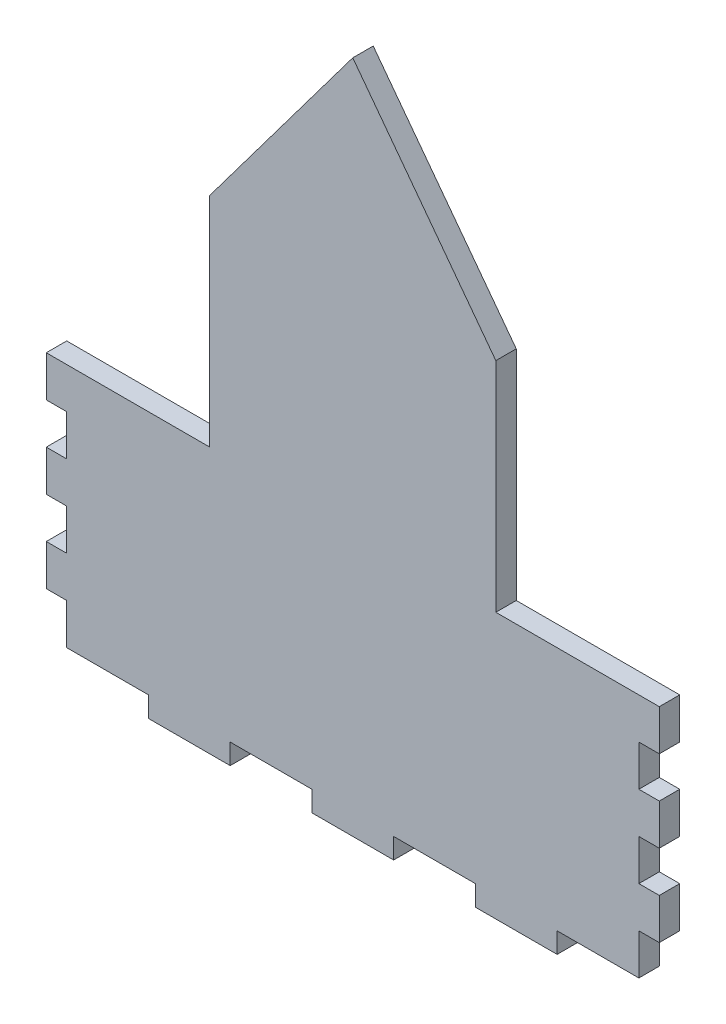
ISO-10303-21;
HEADER;
FILE_DESCRIPTION(('STEP AP214'),'2;1');
FILE_NAME('part.step','',(''),(''),'','','');
FILE_SCHEMA(('AUTOMOTIVE_DESIGN { 1 0 10303 214 1 1 1 1 }'));
ENDSEC;
DATA;
#1=APPLICATION_CONTEXT('core data for automotive mechanical design processes');
#2=APPLICATION_PROTOCOL_DEFINITION('international standard','automotive_design',2000,#1);
#3=PRODUCT_CONTEXT('',#1,'mechanical');
#4=PRODUCT('Part','Part','',(#3));
#5=PRODUCT_RELATED_PRODUCT_CATEGORY('part','',(#4));
#6=PRODUCT_DEFINITION_FORMATION('','',#4);
#7=PRODUCT_DEFINITION_CONTEXT('part definition',#1,'design');
#8=PRODUCT_DEFINITION('design','',#6,#7);
#9=PRODUCT_DEFINITION_SHAPE('','',#8);
#10=(LENGTH_UNIT() NAMED_UNIT(*) SI_UNIT(.MILLI.,.METRE.));
#11=(NAMED_UNIT(*) PLANE_ANGLE_UNIT() SI_UNIT($,.RADIAN.));
#12=(NAMED_UNIT(*) SI_UNIT($,.STERADIAN.) SOLID_ANGLE_UNIT());
#13=UNCERTAINTY_MEASURE_WITH_UNIT(LENGTH_MEASURE(1.E-05),#10,'distance_accuracy_value','');
#14=(GEOMETRIC_REPRESENTATION_CONTEXT(3) GLOBAL_UNCERTAINTY_ASSIGNED_CONTEXT((#13)) GLOBAL_UNIT_ASSIGNED_CONTEXT((#10,
#11,#12)) REPRESENTATION_CONTEXT('',''));
#15=CARTESIAN_POINT('',(0.,0.,0.));
#16=DIRECTION('',(0.,0.,1.));
#17=DIRECTION('',(1.,0.,0.));
#18=AXIS2_PLACEMENT_3D('',#15,#16,#17);
#19=CARTESIAN_POINT('',(175.806307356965,0.,12.7));
#20=DIRECTION('',(0.,1.,0.));
#21=DIRECTION('',(0.,0.,1.));
#22=AXIS2_PLACEMENT_3D('',#19,#20,#21);
#23=PLANE('',#22);
#24=DIRECTION('',(0.,0.,-1.));
#25=VECTOR('',#24,1.);
#26=CARTESIAN_POINT('',(254.,0.,-270.559651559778));
#27=LINE('',#26,#25);
#28=CARTESIAN_POINT('',(254.,0.,12.7));
#29=VERTEX_POINT('',#28);
#30=CARTESIAN_POINT('',(254.,0.,0.));
#31=VERTEX_POINT('',#30);
#32=EDGE_CURVE('E60',#29,#31,#27,.T.);
#33=ORIENTED_EDGE('',*,*,#32,.F.);
#34=DIRECTION('',(1.,0.,0.));
#35=VECTOR('',#34,1.);
#36=CARTESIAN_POINT('',(175.806307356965,0.,12.7));
#37=LINE('',#36,#35);
#38=CARTESIAN_POINT('',(203.2,0.,12.7));
#39=VERTEX_POINT('',#38);
#40=EDGE_CURVE('E323',#39,#29,#37,.T.);
#41=ORIENTED_EDGE('',*,*,#40,.F.);
#42=DIRECTION('',(0.,0.,-1.));
#43=VECTOR('',#42,1.);
#44=CARTESIAN_POINT('',(203.2,0.,-270.559651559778));
#45=LINE('',#44,#43);
#46=CARTESIAN_POINT('',(203.2,0.,0.));
#47=VERTEX_POINT('',#46);
#48=EDGE_CURVE('E324',#39,#47,#45,.T.);
#49=ORIENTED_EDGE('',*,*,#48,.T.);
#50=DIRECTION('',(1.,0.,0.));
#51=VECTOR('',#50,1.);
#52=CARTESIAN_POINT('',(175.806307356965,0.,0.));
#53=LINE('',#52,#51);
#54=EDGE_CURVE('E381',#47,#31,#53,.T.);
#55=ORIENTED_EDGE('',*,*,#54,.T.);
#56=EDGE_LOOP('',(#33,#41,#49,#55));
#57=FACE_BOUND('',#56,.T.);
#58=ADVANCED_FACE('F35',(#57),#23,.F.);
#59=DIRECTION('',(0.,0.,-1.));
#60=VECTOR('',#59,1.);
#61=CARTESIAN_POINT('',(152.4,0.,-270.559651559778));
#62=LINE('',#61,#60);
#63=CARTESIAN_POINT('',(152.4,0.,12.7));
#64=VERTEX_POINT('',#63);
#65=CARTESIAN_POINT('',(152.4,0.,0.));
#66=VERTEX_POINT('',#65);
#67=EDGE_CURVE('E327',#64,#66,#62,.T.);
#68=ORIENTED_EDGE('',*,*,#67,.F.);
#69=CARTESIAN_POINT('',(101.6,0.,12.7));
#70=VERTEX_POINT('',#69);
#71=EDGE_CURVE('E671',#70,#64,#37,.T.);
#72=ORIENTED_EDGE('',*,*,#71,.F.);
#73=DIRECTION('',(0.,0.,-1.));
#74=VECTOR('',#73,1.);
#75=CARTESIAN_POINT('',(101.6,0.,-270.559651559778));
#76=LINE('',#75,#74);
#77=CARTESIAN_POINT('',(101.6,0.,0.));
#78=VERTEX_POINT('',#77);
#79=EDGE_CURVE('E355',#70,#78,#76,.T.);
#80=ORIENTED_EDGE('',*,*,#79,.T.);
#81=EDGE_CURVE('E384',#78,#66,#53,.T.);
#82=ORIENTED_EDGE('',*,*,#81,.T.);
#83=EDGE_LOOP('',(#68,#72,#80,#82));
#84=FACE_BOUND('',#83,.T.);
#85=ADVANCED_FACE('F628',(#84),#23,.F.);
#86=DIRECTION('',(0.,0.,-1.));
#87=VECTOR('',#86,1.);
#88=CARTESIAN_POINT('',(50.8,0.,-270.559651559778));
#89=LINE('',#88,#87);
#90=CARTESIAN_POINT('',(50.8,0.,12.7));
#91=VERTEX_POINT('',#90);
#92=CARTESIAN_POINT('',(50.8,0.,0.));
#93=VERTEX_POINT('',#92);
#94=EDGE_CURVE('E360',#91,#93,#89,.T.);
#95=ORIENTED_EDGE('',*,*,#94,.F.);
#96=CARTESIAN_POINT('',(0.,0.,12.7));
#97=VERTEX_POINT('',#96);
#98=EDGE_CURVE('E421',#97,#91,#37,.T.);
#99=ORIENTED_EDGE('',*,*,#98,.F.);
#100=DIRECTION('',(0.,0.,-1.));
#101=VECTOR('',#100,1.);
#102=CARTESIAN_POINT('',(0.,0.,12.7));
#103=LINE('',#102,#101);
#104=CARTESIAN_POINT('',(0.,0.,0.));
#105=VERTEX_POINT('',#104);
#106=EDGE_CURVE('E690',#97,#105,#103,.T.);
#107=ORIENTED_EDGE('',*,*,#106,.T.);
#108=EDGE_CURVE('E399',#105,#93,#53,.T.);
#109=ORIENTED_EDGE('',*,*,#108,.T.);
#110=EDGE_LOOP('',(#95,#99,#107,#109));
#111=FACE_BOUND('',#110,.T.);
#112=ADVANCED_FACE('F634',(#111),#23,.F.);
#113=CARTESIAN_POINT('',(355.6,-268.81759320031,12.7));
#114=DIRECTION('',(-1.,0.,0.));
#115=DIRECTION('',(0.,-1.,0.));
#116=AXIS2_PLACEMENT_3D('',#113,#114,#115);
#117=PLANE('',#116);
#118=DIRECTION('',(0.,0.,1.));
#119=VECTOR('',#118,1.);
#120=CARTESIAN_POINT('',(355.6,25.4,0.));
#121=LINE('',#120,#119);
#122=CARTESIAN_POINT('',(355.6,25.4,0.));
#123=VERTEX_POINT('',#122);
#124=CARTESIAN_POINT('',(355.6,25.4,12.7));
#125=VERTEX_POINT('',#124);
#126=EDGE_CURVE('E771',#123,#125,#121,.T.);
#127=ORIENTED_EDGE('',*,*,#126,.T.);
#128=DIRECTION('',(0.,1.,0.));
#129=VECTOR('',#128,1.);
#130=CARTESIAN_POINT('',(355.6,-268.81759320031,12.7));
#131=LINE('',#130,#129);
#132=CARTESIAN_POINT('',(355.6,0.,12.7));
#133=VERTEX_POINT('',#132);
#134=EDGE_CURVE('E405',#133,#125,#131,.T.);
#135=ORIENTED_EDGE('',*,*,#134,.F.);
#136=DIRECTION('',(0.,0.,-1.));
#137=VECTOR('',#136,1.);
#138=CARTESIAN_POINT('',(355.6,0.,12.7));
#139=LINE('',#138,#137);
#140=CARTESIAN_POINT('',(355.6,0.,0.));
#141=VERTEX_POINT('',#140);
#142=EDGE_CURVE('E693',#133,#141,#139,.T.);
#143=ORIENTED_EDGE('',*,*,#142,.T.);
#144=DIRECTION('',(0.,1.,0.));
#145=VECTOR('',#144,1.);
#146=CARTESIAN_POINT('',(355.6,-268.81759320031,0.));
#147=LINE('',#146,#145);
#148=EDGE_CURVE('E538',#141,#123,#147,.T.);
#149=ORIENTED_EDGE('',*,*,#148,.T.);
#150=EDGE_LOOP('',(#127,#135,#143,#149));
#151=FACE_BOUND('',#150,.T.);
#152=ADVANCED_FACE('F645',(#151),#117,.F.);
#153=DIRECTION('',(0.,0.,1.));
#154=VECTOR('',#153,1.);
#155=CARTESIAN_POINT('',(355.6,101.6,0.));
#156=LINE('',#155,#154);
#157=CARTESIAN_POINT('',(355.6,101.6,0.));
#158=VERTEX_POINT('',#157);
#159=CARTESIAN_POINT('',(355.6,101.6,12.7));
#160=VERTEX_POINT('',#159);
#161=EDGE_CURVE('E565',#158,#160,#156,.T.);
#162=ORIENTED_EDGE('',*,*,#161,.F.);
#163=CARTESIAN_POINT('',(355.6,127.,0.));
#164=VERTEX_POINT('',#163);
#165=EDGE_CURVE('E401',#158,#164,#147,.T.);
#166=ORIENTED_EDGE('',*,*,#165,.T.);
#167=DIRECTION('',(0.,0.,1.));
#168=VECTOR('',#167,1.);
#169=CARTESIAN_POINT('',(355.6,127.,0.));
#170=LINE('',#169,#168);
#171=CARTESIAN_POINT('',(355.6,127.,12.7));
#172=VERTEX_POINT('',#171);
#173=EDGE_CURVE('E430',#164,#172,#170,.T.);
#174=ORIENTED_EDGE('',*,*,#173,.T.);
#175=EDGE_CURVE('E406',#160,#172,#131,.T.);
#176=ORIENTED_EDGE('',*,*,#175,.F.);
#177=EDGE_LOOP('',(#162,#166,#174,#176));
#178=FACE_BOUND('',#177,.T.);
#179=ADVANCED_FACE('F606',(#178),#117,.F.);
#180=CARTESIAN_POINT('',(0.,-268.81759320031,12.7));
#181=DIRECTION('',(-1.,0.,0.));
#182=DIRECTION('',(0.,0.,1.));
#183=AXIS2_PLACEMENT_3D('',#180,#181,#182);
#184=PLANE('',#183);
#185=DIRECTION('',(0.,1.,0.));
#186=VECTOR('',#185,1.);
#187=CARTESIAN_POINT('',(0.,-268.81759320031,12.7));
#188=LINE('',#187,#186);
#189=CARTESIAN_POINT('',(0.,25.4,12.7));
#190=VERTEX_POINT('',#189);
#191=EDGE_CURVE('E513',#97,#190,#188,.T.);
#192=ORIENTED_EDGE('',*,*,#191,.T.);
#193=DIRECTION('',(0.,0.,1.));
#194=VECTOR('',#193,1.);
#195=CARTESIAN_POINT('',(0.,25.4,0.));
#196=LINE('',#195,#194);
#197=CARTESIAN_POINT('',(0.,25.4,0.));
#198=VERTEX_POINT('',#197);
#199=EDGE_CURVE('E464',#198,#190,#196,.T.);
#200=ORIENTED_EDGE('',*,*,#199,.F.);
#201=DIRECTION('',(0.,1.,0.));
#202=VECTOR('',#201,1.);
#203=CARTESIAN_POINT('',(0.,-268.81759320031,0.));
#204=LINE('',#203,#202);
#205=EDGE_CURVE('E691',#105,#198,#204,.T.);
#206=ORIENTED_EDGE('',*,*,#205,.F.);
#207=ORIENTED_EDGE('',*,*,#106,.F.);
#208=EDGE_LOOP('',(#192,#200,#206,#207));
#209=FACE_BOUND('',#208,.T.);
#210=ADVANCED_FACE('F648',(#209),#184,.T.);
#211=CARTESIAN_POINT('',(0.,101.6,0.));
#212=VERTEX_POINT('',#211);
#213=CARTESIAN_POINT('',(0.,127.,0.));
#214=VERTEX_POINT('',#213);
#215=EDGE_CURVE('E524',#212,#214,#204,.T.);
#216=ORIENTED_EDGE('',*,*,#215,.F.);
#217=DIRECTION('',(0.,0.,1.));
#218=VECTOR('',#217,1.);
#219=CARTESIAN_POINT('',(0.,101.6,0.));
#220=LINE('',#219,#218);
#221=CARTESIAN_POINT('',(0.,101.6,12.7));
#222=VERTEX_POINT('',#221);
#223=EDGE_CURVE('E486',#212,#222,#220,.T.);
#224=ORIENTED_EDGE('',*,*,#223,.T.);
#225=CARTESIAN_POINT('',(0.,127.,12.7));
#226=VERTEX_POINT('',#225);
#227=EDGE_CURVE('E528',#222,#226,#188,.T.);
#228=ORIENTED_EDGE('',*,*,#227,.T.);
#229=DIRECTION('',(0.,0.,1.));
#230=VECTOR('',#229,1.);
#231=CARTESIAN_POINT('',(0.,127.,0.));
#232=LINE('',#231,#230);
#233=EDGE_CURVE('E508',#214,#226,#232,.T.);
#234=ORIENTED_EDGE('',*,*,#233,.F.);
#235=EDGE_LOOP('',(#216,#224,#228,#234));
#236=FACE_BOUND('',#235,.T.);
#237=ADVANCED_FACE('F649',(#236),#184,.T.);
#238=CARTESIAN_POINT('',(501.180298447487,-24.8045293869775,12.7));
#239=DIRECTION('',(0.800020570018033,0.599972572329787,0.));
#240=DIRECTION('',(-0.599972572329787,0.800020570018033,0.));
#241=AXIS2_PLACEMENT_3D('',#238,#239,#240);
#242=PLANE('',#241);
#243=DIRECTION('',(0.599972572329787,-0.800020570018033,0.));
#244=VECTOR('',#243,1.);
#245=CARTESIAN_POINT('',(501.180298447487,-24.8045293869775,0.));
#246=LINE('',#245,#244);
#247=CARTESIAN_POINT('',(177.8,406.4,0.));
#248=VERTEX_POINT('',#247);
#249=CARTESIAN_POINT('',(266.7,287.8582,0.));
#250=VERTEX_POINT('',#249);
#251=EDGE_CURVE('E512',#248,#250,#246,.T.);
#252=ORIENTED_EDGE('',*,*,#251,.F.);
#253=DIRECTION('',(0.,0.,-1.));
#254=VECTOR('',#253,1.);
#255=CARTESIAN_POINT('',(177.8,406.4,12.7));
#256=LINE('',#255,#254);
#257=CARTESIAN_POINT('',(177.8,406.4,12.7));
#258=VERTEX_POINT('',#257);
#259=EDGE_CURVE('E11',#258,#248,#256,.T.);
#260=ORIENTED_EDGE('',*,*,#259,.F.);
#261=DIRECTION('',(0.599972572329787,-0.800020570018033,0.));
#262=VECTOR('',#261,1.);
#263=CARTESIAN_POINT('',(501.180298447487,-24.8045293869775,12.7));
#264=LINE('',#263,#262);
#265=CARTESIAN_POINT('',(266.7,287.8582,12.7));
#266=VERTEX_POINT('',#265);
#267=EDGE_CURVE('E734',#258,#266,#264,.T.);
#268=ORIENTED_EDGE('',*,*,#267,.T.);
#269=DIRECTION('',(0.,0.,-1.));
#270=VECTOR('',#269,1.);
#271=CARTESIAN_POINT('',(266.7,287.8582,12.7));
#272=LINE('',#271,#270);
#273=EDGE_CURVE('E758',#266,#250,#272,.T.);
#274=ORIENTED_EDGE('',*,*,#273,.T.);
#275=EDGE_LOOP('',(#252,#260,#268,#274));
#276=FACE_BOUND('',#275,.T.);
#277=ADVANCED_FACE('F37',(#276),#242,.T.);
#278=CARTESIAN_POINT('',(-147.015625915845,-26.7184360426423,12.7));
#279=DIRECTION('',(-0.800020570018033,0.599972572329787,0.));
#280=DIRECTION('',(-0.599972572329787,-0.800020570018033,0.));
#281=AXIS2_PLACEMENT_3D('',#278,#279,#280);
#282=PLANE('',#281);
#283=DIRECTION('',(0.599972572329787,0.800020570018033,0.));
#284=VECTOR('',#283,1.);
#285=CARTESIAN_POINT('',(-147.015625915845,-26.7184360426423,0.));
#286=LINE('',#285,#284);
#287=CARTESIAN_POINT('',(88.9,287.8582,0.));
#288=VERTEX_POINT('',#287);
#289=EDGE_CURVE('E750',#288,#248,#286,.T.);
#290=ORIENTED_EDGE('',*,*,#289,.F.);
#291=DIRECTION('',(0.,0.,-1.));
#292=VECTOR('',#291,1.);
#293=CARTESIAN_POINT('',(88.9,287.8582,12.7));
#294=LINE('',#293,#292);
#295=CARTESIAN_POINT('',(88.9,287.8582,12.7));
#296=VERTEX_POINT('',#295);
#297=EDGE_CURVE('E45',#296,#288,#294,.T.);
#298=ORIENTED_EDGE('',*,*,#297,.F.);
#299=DIRECTION('',(0.599972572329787,0.800020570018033,0.));
#300=VECTOR('',#299,1.);
#301=CARTESIAN_POINT('',(-147.015625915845,-26.7184360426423,12.7));
#302=LINE('',#301,#300);
#303=EDGE_CURVE('E737',#296,#258,#302,.T.);
#304=ORIENTED_EDGE('',*,*,#303,.T.);
#305=ORIENTED_EDGE('',*,*,#259,.T.);
#306=EDGE_LOOP('',(#290,#298,#304,#305));
#307=FACE_BOUND('',#306,.T.);
#308=ADVANCED_FACE('F747',(#307),#282,.T.);
#309=CARTESIAN_POINT('',(88.9,-268.81759320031,12.7));
#310=DIRECTION('',(-1.,0.,0.));
#311=DIRECTION('',(0.,0.,1.));
#312=AXIS2_PLACEMENT_3D('',#309,#310,#311);
#313=PLANE('',#312);
#314=DIRECTION('',(0.,1.,0.));
#315=VECTOR('',#314,1.);
#316=CARTESIAN_POINT('',(88.9,-268.81759320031,0.));
#317=LINE('',#316,#315);
#318=CARTESIAN_POINT('',(88.9,152.4,0.));
#319=VERTEX_POINT('',#318);
#320=EDGE_CURVE('E753',#319,#288,#317,.T.);
#321=ORIENTED_EDGE('',*,*,#320,.F.);
#322=DIRECTION('',(0.,0.,-1.));
#323=VECTOR('',#322,1.);
#324=CARTESIAN_POINT('',(88.9,152.4,12.7));
#325=LINE('',#324,#323);
#326=CARTESIAN_POINT('',(88.9,152.4,12.7));
#327=VERTEX_POINT('',#326);
#328=EDGE_CURVE('E692',#327,#319,#325,.T.);
#329=ORIENTED_EDGE('',*,*,#328,.F.);
#330=DIRECTION('',(0.,1.,0.));
#331=VECTOR('',#330,1.);
#332=CARTESIAN_POINT('',(88.9,-268.81759320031,12.7));
#333=LINE('',#332,#331);
#334=EDGE_CURVE('E739',#327,#296,#333,.T.);
#335=ORIENTED_EDGE('',*,*,#334,.T.);
#336=ORIENTED_EDGE('',*,*,#297,.T.);
#337=EDGE_LOOP('',(#321,#329,#335,#336));
#338=FACE_BOUND('',#337,.T.);
#339=ADVANCED_FACE('F752',(#338),#313,.T.);
#340=CARTESIAN_POINT('',(175.806307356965,152.4,12.7));
#341=DIRECTION('',(0.,1.,0.));
#342=DIRECTION('',(0.,0.,1.));
#343=AXIS2_PLACEMENT_3D('',#340,#341,#342);
#344=PLANE('',#343);
#345=DIRECTION('',(1.,0.,0.));
#346=VECTOR('',#345,1.);
#347=CARTESIAN_POINT('',(175.806307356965,152.4,0.));
#348=LINE('',#347,#346);
#349=CARTESIAN_POINT('',(-12.7,152.4,0.));
#350=VERTEX_POINT('',#349);
#351=EDGE_CURVE('E527',#350,#319,#348,.T.);
#352=ORIENTED_EDGE('',*,*,#351,.F.);
#353=DIRECTION('',(0.,0.,1.));
#354=VECTOR('',#353,1.);
#355=CARTESIAN_POINT('',(-12.7,152.4,0.));
#356=LINE('',#355,#354);
#357=CARTESIAN_POINT('',(-12.7,152.4,12.7));
#358=VERTEX_POINT('',#357);
#359=EDGE_CURVE('E521',#350,#358,#356,.T.);
#360=ORIENTED_EDGE('',*,*,#359,.T.);
#361=DIRECTION('',(1.,0.,0.));
#362=VECTOR('',#361,1.);
#363=CARTESIAN_POINT('',(175.806307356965,152.4,12.7));
#364=LINE('',#363,#362);
#365=EDGE_CURVE('E531',#358,#327,#364,.T.);
#366=ORIENTED_EDGE('',*,*,#365,.T.);
#367=ORIENTED_EDGE('',*,*,#328,.T.);
#368=EDGE_LOOP('',(#352,#360,#366,#367));
#369=FACE_BOUND('',#368,.T.);
#370=ADVANCED_FACE('F646',(#369),#344,.T.);
#371=DIRECTION('',(0.,0.,1.));
#372=VECTOR('',#371,1.);
#373=CARTESIAN_POINT('',(0.,50.8,0.));
#374=LINE('',#373,#372);
#375=CARTESIAN_POINT('',(0.,50.8,0.));
#376=VERTEX_POINT('',#375);
#377=CARTESIAN_POINT('',(0.,50.8,12.7));
#378=VERTEX_POINT('',#377);
#379=EDGE_CURVE('E460',#376,#378,#374,.T.);
#380=ORIENTED_EDGE('',*,*,#379,.T.);
#381=CARTESIAN_POINT('',(0.,76.2,12.7));
#382=VERTEX_POINT('',#381);
#383=EDGE_CURVE('E530',#378,#382,#188,.T.);
#384=ORIENTED_EDGE('',*,*,#383,.T.);
#385=DIRECTION('',(0.,0.,1.));
#386=VECTOR('',#385,1.);
#387=CARTESIAN_POINT('',(0.,76.2,0.));
#388=LINE('',#387,#386);
#389=CARTESIAN_POINT('',(0.,76.2,0.));
#390=VERTEX_POINT('',#389);
#391=EDGE_CURVE('E490',#390,#382,#388,.T.);
#392=ORIENTED_EDGE('',*,*,#391,.F.);
#393=EDGE_CURVE('E526',#376,#390,#204,.T.);
#394=ORIENTED_EDGE('',*,*,#393,.F.);
#395=EDGE_LOOP('',(#380,#384,#392,#394));
#396=FACE_BOUND('',#395,.T.);
#397=ADVANCED_FACE('F639',(#396),#184,.T.);
#398=CARTESIAN_POINT('',(304.8,0.,12.7));
#399=VERTEX_POINT('',#398);
#400=EDGE_CURVE('E39',#399,#133,#37,.T.);
#401=ORIENTED_EDGE('',*,*,#400,.F.);
#402=DIRECTION('',(0.,0.,-1.));
#403=VECTOR('',#402,1.);
#404=CARTESIAN_POINT('',(304.8,0.,-270.559651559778));
#405=LINE('',#404,#403);
#406=CARTESIAN_POINT('',(304.8,0.,0.));
#407=VERTEX_POINT('',#406);
#408=EDGE_CURVE('E318',#399,#407,#405,.T.);
#409=ORIENTED_EDGE('',*,*,#408,.T.);
#410=EDGE_CURVE('E385',#407,#141,#53,.T.);
#411=ORIENTED_EDGE('',*,*,#410,.T.);
#412=ORIENTED_EDGE('',*,*,#142,.F.);
#413=EDGE_LOOP('',(#401,#409,#411,#412));
#414=FACE_BOUND('',#413,.T.);
#415=ADVANCED_FACE('F630',(#414),#23,.F.);
#416=CARTESIAN_POINT('',(355.6,50.8,12.7));
#417=VERTEX_POINT('',#416);
#418=CARTESIAN_POINT('',(355.6,76.1999999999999,12.7));
#419=VERTEX_POINT('',#418);
#420=EDGE_CURVE('E402',#417,#419,#131,.T.);
#421=ORIENTED_EDGE('',*,*,#420,.F.);
#422=DIRECTION('',(0.,0.,1.));
#423=VECTOR('',#422,1.);
#424=CARTESIAN_POINT('',(355.6,50.8,0.));
#425=LINE('',#424,#423);
#426=CARTESIAN_POINT('',(355.6,50.8,0.));
#427=VERTEX_POINT('',#426);
#428=EDGE_CURVE('E553',#427,#417,#425,.T.);
#429=ORIENTED_EDGE('',*,*,#428,.F.);
#430=CARTESIAN_POINT('',(355.6,76.1999999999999,0.));
#431=VERTEX_POINT('',#430);
#432=EDGE_CURVE('E407',#427,#431,#147,.T.);
#433=ORIENTED_EDGE('',*,*,#432,.T.);
#434=DIRECTION('',(0.,0.,1.));
#435=VECTOR('',#434,1.);
#436=CARTESIAN_POINT('',(355.6,76.2,0.));
#437=LINE('',#436,#435);
#438=EDGE_CURVE('E550',#431,#419,#437,.T.);
#439=ORIENTED_EDGE('',*,*,#438,.T.);
#440=EDGE_LOOP('',(#421,#429,#433,#439));
#441=FACE_BOUND('',#440,.T.);
#442=ADVANCED_FACE('F549',(#441),#117,.F.);
#443=CARTESIAN_POINT('',(175.806307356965,152.4,12.7));
#444=DIRECTION('',(0.,1.,0.));
#445=DIRECTION('',(0.,0.,1.));
#446=AXIS2_PLACEMENT_3D('',#443,#444,#445);
#447=PLANE('',#446);
#448=DIRECTION('',(1.,0.,0.));
#449=VECTOR('',#448,1.);
#450=CARTESIAN_POINT('',(175.806307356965,152.4,0.));
#451=LINE('',#450,#449);
#452=CARTESIAN_POINT('',(266.7,152.4,0.));
#453=VERTEX_POINT('',#452);
#454=CARTESIAN_POINT('',(368.3,152.4,0.));
#455=VERTEX_POINT('',#454);
#456=EDGE_CURVE('E539',#453,#455,#451,.T.);
#457=ORIENTED_EDGE('',*,*,#456,.F.);
#458=DIRECTION('',(0.,0.,-1.));
#459=VECTOR('',#458,1.);
#460=CARTESIAN_POINT('',(266.7,152.4,12.7));
#461=LINE('',#460,#459);
#462=CARTESIAN_POINT('',(266.7,152.4,12.7));
#463=VERTEX_POINT('',#462);
#464=EDGE_CURVE('E696',#463,#453,#461,.T.);
#465=ORIENTED_EDGE('',*,*,#464,.F.);
#466=DIRECTION('',(1.,0.,0.));
#467=VECTOR('',#466,1.);
#468=CARTESIAN_POINT('',(175.806307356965,152.4,12.7));
#469=LINE('',#468,#467);
#470=CARTESIAN_POINT('',(368.3,152.4,12.7));
#471=VERTEX_POINT('',#470);
#472=EDGE_CURVE('E413',#463,#471,#469,.T.);
#473=ORIENTED_EDGE('',*,*,#472,.T.);
#474=DIRECTION('',(0.,0.,1.));
#475=VECTOR('',#474,1.);
#476=CARTESIAN_POINT('',(368.3,152.4,0.));
#477=LINE('',#476,#475);
#478=EDGE_CURVE('E428',#455,#471,#477,.T.);
#479=ORIENTED_EDGE('',*,*,#478,.F.);
#480=EDGE_LOOP('',(#457,#465,#473,#479));
#481=FACE_BOUND('',#480,.T.);
#482=ADVANCED_FACE('F644',(#481),#447,.T.);
#483=CARTESIAN_POINT('',(266.7,-268.81759320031,12.7));
#484=DIRECTION('',(-1.,0.,0.));
#485=DIRECTION('',(0.,0.,1.));
#486=AXIS2_PLACEMENT_3D('',#483,#484,#485);
#487=PLANE('',#486);
#488=DIRECTION('',(0.,1.,0.));
#489=VECTOR('',#488,1.);
#490=CARTESIAN_POINT('',(266.7,-268.81759320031,0.));
#491=LINE('',#490,#489);
#492=EDGE_CURVE('E544',#453,#250,#491,.T.);
#493=ORIENTED_EDGE('',*,*,#492,.T.);
#494=ORIENTED_EDGE('',*,*,#273,.F.);
#495=DIRECTION('',(0.,1.,0.));
#496=VECTOR('',#495,1.);
#497=CARTESIAN_POINT('',(266.7,-268.81759320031,12.7));
#498=LINE('',#497,#496);
#499=EDGE_CURVE('E757',#463,#266,#498,.T.);
#500=ORIENTED_EDGE('',*,*,#499,.F.);
#501=ORIENTED_EDGE('',*,*,#464,.T.);
#502=EDGE_LOOP('',(#493,#494,#500,#501));
#503=FACE_BOUND('',#502,.T.);
#504=ADVANCED_FACE('F872',(#503),#487,.F.);
#505=CARTESIAN_POINT('',(175.806307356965,-268.81759320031,12.7));
#506=DIRECTION('',(0.,0.,1.));
#507=DIRECTION('',(1.,0.,0.));
#508=AXIS2_PLACEMENT_3D('',#505,#506,#507);
#509=PLANE('',#508);
#510=ORIENTED_EDGE('',*,*,#267,.F.);
#511=ORIENTED_EDGE('',*,*,#303,.F.);
#512=ORIENTED_EDGE('',*,*,#334,.F.);
#513=ORIENTED_EDGE('',*,*,#365,.F.);
#514=DIRECTION('',(0.,-1.,0.));
#515=VECTOR('',#514,1.);
#516=CARTESIAN_POINT('',(-12.7,-407.170012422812,12.7));
#517=LINE('',#516,#515);
#518=CARTESIAN_POINT('',(-12.7,127.,12.7));
#519=VERTEX_POINT('',#518);
#520=EDGE_CURVE('E489',#358,#519,#517,.T.);
#521=ORIENTED_EDGE('',*,*,#520,.T.);
#522=DIRECTION('',(1.,0.,0.));
#523=VECTOR('',#522,1.);
#524=CARTESIAN_POINT('',(199.891416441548,127.,12.7));
#525=LINE('',#524,#523);
#526=EDGE_CURVE('E500',#519,#226,#525,.T.);
#527=ORIENTED_EDGE('',*,*,#526,.T.);
#528=ORIENTED_EDGE('',*,*,#227,.F.);
#529=DIRECTION('',(1.,0.,0.));
#530=VECTOR('',#529,1.);
#531=CARTESIAN_POINT('',(199.891416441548,101.6,12.7));
#532=LINE('',#531,#530);
#533=CARTESIAN_POINT('',(-12.7,101.6,12.7));
#534=VERTEX_POINT('',#533);
#535=EDGE_CURVE('E463',#534,#222,#532,.T.);
#536=ORIENTED_EDGE('',*,*,#535,.F.);
#537=DIRECTION('',(0.,-1.,0.));
#538=VECTOR('',#537,1.);
#539=CARTESIAN_POINT('',(-12.7,-407.170012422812,12.7));
#540=LINE('',#539,#538);
#541=CARTESIAN_POINT('',(-12.7,76.2,12.7));
#542=VERTEX_POINT('',#541);
#543=EDGE_CURVE('E481',#534,#542,#540,.T.);
#544=ORIENTED_EDGE('',*,*,#543,.T.);
#545=DIRECTION('',(1.,0.,0.));
#546=VECTOR('',#545,1.);
#547=CARTESIAN_POINT('',(199.891416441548,76.2,12.7));
#548=LINE('',#547,#546);
#549=EDGE_CURVE('E473',#542,#382,#548,.T.);
#550=ORIENTED_EDGE('',*,*,#549,.T.);
#551=ORIENTED_EDGE('',*,*,#383,.F.);
#552=DIRECTION('',(-1.,0.,0.));
#553=VECTOR('',#552,1.);
#554=CARTESIAN_POINT('',(199.891416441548,50.8,12.7));
#555=LINE('',#554,#553);
#556=CARTESIAN_POINT('',(-12.7,50.8,12.7));
#557=VERTEX_POINT('',#556);
#558=EDGE_CURVE('E452',#378,#557,#555,.T.);
#559=ORIENTED_EDGE('',*,*,#558,.T.);
#560=DIRECTION('',(0.,-1.,0.));
#561=VECTOR('',#560,1.);
#562=CARTESIAN_POINT('',(-12.7,-407.170012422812,12.7));
#563=LINE('',#562,#561);
#564=CARTESIAN_POINT('',(-12.7,25.4,12.7));
#565=VERTEX_POINT('',#564);
#566=EDGE_CURVE('E455',#557,#565,#563,.T.);
#567=ORIENTED_EDGE('',*,*,#566,.T.);
#568=DIRECTION('',(-1.,0.,0.));
#569=VECTOR('',#568,1.);
#570=CARTESIAN_POINT('',(199.891416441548,25.4,12.7));
#571=LINE('',#570,#569);
#572=EDGE_CURVE('E446',#190,#565,#571,.T.);
#573=ORIENTED_EDGE('',*,*,#572,.F.);
#574=ORIENTED_EDGE('',*,*,#191,.F.);
#575=ORIENTED_EDGE('',*,*,#98,.T.);
#576=DIRECTION('',(0.,1.,0.));
#577=VECTOR('',#576,1.);
#578=CARTESIAN_POINT('',(50.8,-12.7,12.7));
#579=LINE('',#578,#577);
#580=CARTESIAN_POINT('',(50.8,-12.7,12.7));
#581=VERTEX_POINT('',#580);
#582=EDGE_CURVE('E667',#581,#91,#579,.T.);
#583=ORIENTED_EDGE('',*,*,#582,.F.);
#584=DIRECTION('',(-1.,0.,0.));
#585=VECTOR('',#584,1.);
#586=CARTESIAN_POINT('',(177.8,-12.7,12.7));
#587=LINE('',#586,#585);
#588=CARTESIAN_POINT('',(101.6,-12.7,12.7));
#589=VERTEX_POINT('',#588);
#590=EDGE_CURVE('E359',#589,#581,#587,.T.);
#591=ORIENTED_EDGE('',*,*,#590,.F.);
#592=DIRECTION('',(0.,1.,0.));
#593=VECTOR('',#592,1.);
#594=CARTESIAN_POINT('',(101.6,-12.7,12.7));
#595=LINE('',#594,#593);
#596=EDGE_CURVE('E673',#589,#70,#595,.T.);
#597=ORIENTED_EDGE('',*,*,#596,.T.);
#598=ORIENTED_EDGE('',*,*,#71,.T.);
#599=DIRECTION('',(0.,1.,0.));
#600=VECTOR('',#599,1.);
#601=CARTESIAN_POINT('',(152.4,-12.7,12.7));
#602=LINE('',#601,#600);
#603=CARTESIAN_POINT('',(152.4,-12.7,12.7));
#604=VERTEX_POINT('',#603);
#605=EDGE_CURVE('E350',#604,#64,#602,.T.);
#606=ORIENTED_EDGE('',*,*,#605,.F.);
#607=DIRECTION('',(-1.,0.,0.));
#608=VECTOR('',#607,1.);
#609=CARTESIAN_POINT('',(177.8,-12.7,12.7));
#610=LINE('',#609,#608);
#611=CARTESIAN_POINT('',(203.2,-12.7,12.7));
#612=VERTEX_POINT('',#611);
#613=EDGE_CURVE('E336',#612,#604,#610,.T.);
#614=ORIENTED_EDGE('',*,*,#613,.F.);
#615=DIRECTION('',(0.,1.,0.));
#616=VECTOR('',#615,1.);
#617=CARTESIAN_POINT('',(203.2,-12.7,12.7));
#618=LINE('',#617,#616);
#619=EDGE_CURVE('E353',#612,#39,#618,.T.);
#620=ORIENTED_EDGE('',*,*,#619,.T.);
#621=ORIENTED_EDGE('',*,*,#40,.T.);
#622=DIRECTION('',(0.,1.,0.));
#623=VECTOR('',#622,1.);
#624=CARTESIAN_POINT('',(254.,-12.7,12.7));
#625=LINE('',#624,#623);
#626=CARTESIAN_POINT('',(254.,-12.7,12.7));
#627=VERTEX_POINT('',#626);
#628=EDGE_CURVE('E304',#627,#29,#625,.T.);
#629=ORIENTED_EDGE('',*,*,#628,.F.);
#630=DIRECTION('',(-1.,0.,0.));
#631=VECTOR('',#630,1.);
#632=CARTESIAN_POINT('',(177.8,-12.7,12.7));
#633=LINE('',#632,#631);
#634=CARTESIAN_POINT('',(304.8,-12.7,12.7));
#635=VERTEX_POINT('',#634);
#636=EDGE_CURVE('E310',#635,#627,#633,.T.);
#637=ORIENTED_EDGE('',*,*,#636,.F.);
#638=DIRECTION('',(0.,1.,0.));
#639=VECTOR('',#638,1.);
#640=CARTESIAN_POINT('',(304.8,-12.7,12.7));
#641=LINE('',#640,#639);
#642=EDGE_CURVE('E971',#635,#399,#641,.T.);
#643=ORIENTED_EDGE('',*,*,#642,.T.);
#644=ORIENTED_EDGE('',*,*,#400,.T.);
#645=ORIENTED_EDGE('',*,*,#134,.T.);
#646=DIRECTION('',(-1.,0.,0.));
#647=VECTOR('',#646,1.);
#648=CARTESIAN_POINT('',(199.891416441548,25.4,12.7));
#649=LINE('',#648,#647);
#650=CARTESIAN_POINT('',(368.3,25.4,12.7));
#651=VERTEX_POINT('',#650);
#652=EDGE_CURVE('E766',#651,#125,#649,.T.);
#653=ORIENTED_EDGE('',*,*,#652,.F.);
#654=DIRECTION('',(0.,-1.,0.));
#655=VECTOR('',#654,1.);
#656=CARTESIAN_POINT('',(368.3,-407.170012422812,12.7));
#657=LINE('',#656,#655);
#658=CARTESIAN_POINT('',(368.3,50.8,12.7));
#659=VERTEX_POINT('',#658);
#660=EDGE_CURVE('E676',#659,#651,#657,.T.);
#661=ORIENTED_EDGE('',*,*,#660,.F.);
#662=DIRECTION('',(-1.,0.,0.));
#663=VECTOR('',#662,1.);
#664=CARTESIAN_POINT('',(199.891416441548,50.8,12.7));
#665=LINE('',#664,#663);
#666=EDGE_CURVE('E775',#659,#417,#665,.T.);
#667=ORIENTED_EDGE('',*,*,#666,.T.);
#668=ORIENTED_EDGE('',*,*,#420,.T.);
#669=DIRECTION('',(1.,0.,0.));
#670=VECTOR('',#669,1.);
#671=CARTESIAN_POINT('',(199.891416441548,76.2,12.7));
#672=LINE('',#671,#670);
#673=CARTESIAN_POINT('',(368.3,76.2,12.7));
#674=VERTEX_POINT('',#673);
#675=EDGE_CURVE('E563',#419,#674,#672,.T.);
#676=ORIENTED_EDGE('',*,*,#675,.T.);
#677=DIRECTION('',(0.,-1.,0.));
#678=VECTOR('',#677,1.);
#679=CARTESIAN_POINT('',(368.3,-407.170012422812,12.7));
#680=LINE('',#679,#678);
#681=CARTESIAN_POINT('',(368.3,101.6,12.7));
#682=VERTEX_POINT('',#681);
#683=EDGE_CURVE('E580',#682,#674,#680,.T.);
#684=ORIENTED_EDGE('',*,*,#683,.F.);
#685=DIRECTION('',(1.,0.,0.));
#686=VECTOR('',#685,1.);
#687=CARTESIAN_POINT('',(199.891416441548,101.6,12.7));
#688=LINE('',#687,#686);
#689=EDGE_CURVE('E583',#160,#682,#688,.T.);
#690=ORIENTED_EDGE('',*,*,#689,.F.);
#691=ORIENTED_EDGE('',*,*,#175,.T.);
#692=DIRECTION('',(1.,0.,0.));
#693=VECTOR('',#692,1.);
#694=CARTESIAN_POINT('',(199.891416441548,127.,12.7));
#695=LINE('',#694,#693);
#696=CARTESIAN_POINT('',(368.3,127.,12.7));
#697=VERTEX_POINT('',#696);
#698=EDGE_CURVE('E591',#172,#697,#695,.T.);
#699=ORIENTED_EDGE('',*,*,#698,.T.);
#700=DIRECTION('',(0.,-1.,0.));
#701=VECTOR('',#700,1.);
#702=CARTESIAN_POINT('',(368.3,-407.170012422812,12.7));
#703=LINE('',#702,#701);
#704=EDGE_CURVE('E587',#471,#697,#703,.T.);
#705=ORIENTED_EDGE('',*,*,#704,.F.);
#706=ORIENTED_EDGE('',*,*,#472,.F.);
#707=ORIENTED_EDGE('',*,*,#499,.T.);
#708=EDGE_LOOP('',(#510,#511,#512,#513,#521,#527,#528,#536,#544,#550,#551,#559,#567,#573,#574,
#575,#583,#591,#597,#598,#606,#614,#620,#621,#629,#637,#643,#644,#645,#653,#661,#667,#668,#676,
#684,#690,#691,#699,#705,#706,#707));
#709=FACE_BOUND('',#708,.T.);
#710=ADVANCED_FACE('F321',(#709),#509,.T.);
#711=CARTESIAN_POINT('',(175.806307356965,-268.81759320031,0.));
#712=DIRECTION('',(0.,0.,1.));
#713=DIRECTION('',(1.,0.,0.));
#714=AXIS2_PLACEMENT_3D('',#711,#712,#713);
#715=PLANE('',#714);
#716=ORIENTED_EDGE('',*,*,#251,.T.);
#717=ORIENTED_EDGE('',*,*,#492,.F.);
#718=ORIENTED_EDGE('',*,*,#456,.T.);
#719=DIRECTION('',(0.,-1.,0.));
#720=VECTOR('',#719,1.);
#721=CARTESIAN_POINT('',(368.3,-407.170012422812,0.));
#722=LINE('',#721,#720);
#723=CARTESIAN_POINT('',(368.3,127.,0.));
#724=VERTEX_POINT('',#723);
#725=EDGE_CURVE('E429',#455,#724,#722,.T.);
#726=ORIENTED_EDGE('',*,*,#725,.T.);
#727=DIRECTION('',(1.,0.,0.));
#728=VECTOR('',#727,1.);
#729=CARTESIAN_POINT('',(199.891416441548,127.,0.));
#730=LINE('',#729,#728);
#731=EDGE_CURVE('E425',#164,#724,#730,.T.);
#732=ORIENTED_EDGE('',*,*,#731,.F.);
#733=ORIENTED_EDGE('',*,*,#165,.F.);
#734=DIRECTION('',(1.,0.,0.));
#735=VECTOR('',#734,1.);
#736=CARTESIAN_POINT('',(199.891416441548,101.6,0.));
#737=LINE('',#736,#735);
#738=CARTESIAN_POINT('',(368.3,101.6,0.));
#739=VERTEX_POINT('',#738);
#740=EDGE_CURVE('E573',#158,#739,#737,.T.);
#741=ORIENTED_EDGE('',*,*,#740,.T.);
#742=DIRECTION('',(0.,-1.,0.));
#743=VECTOR('',#742,1.);
#744=CARTESIAN_POINT('',(368.3,-407.170012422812,0.));
#745=LINE('',#744,#743);
#746=CARTESIAN_POINT('',(368.3,76.2,0.));
#747=VERTEX_POINT('',#746);
#748=EDGE_CURVE('E570',#739,#747,#745,.T.);
#749=ORIENTED_EDGE('',*,*,#748,.T.);
#750=DIRECTION('',(1.,0.,0.));
#751=VECTOR('',#750,1.);
#752=CARTESIAN_POINT('',(199.891416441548,76.2,0.));
#753=LINE('',#752,#751);
#754=EDGE_CURVE('E561',#431,#747,#753,.T.);
#755=ORIENTED_EDGE('',*,*,#754,.F.);
#756=ORIENTED_EDGE('',*,*,#432,.F.);
#757=DIRECTION('',(-1.,0.,0.));
#758=VECTOR('',#757,1.);
#759=CARTESIAN_POINT('',(199.891416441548,50.8,0.));
#760=LINE('',#759,#758);
#761=CARTESIAN_POINT('',(368.3,50.8,0.));
#762=VERTEX_POINT('',#761);
#763=EDGE_CURVE('E778',#762,#427,#760,.T.);
#764=ORIENTED_EDGE('',*,*,#763,.F.);
#765=DIRECTION('',(0.,-1.,0.));
#766=VECTOR('',#765,1.);
#767=CARTESIAN_POINT('',(368.3,-407.170012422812,0.));
#768=LINE('',#767,#766);
#769=CARTESIAN_POINT('',(368.3,25.4,0.));
#770=VERTEX_POINT('',#769);
#771=EDGE_CURVE('E774',#762,#770,#768,.T.);
#772=ORIENTED_EDGE('',*,*,#771,.T.);
#773=DIRECTION('',(-1.,0.,0.));
#774=VECTOR('',#773,1.);
#775=CARTESIAN_POINT('',(199.891416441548,25.4,0.));
#776=LINE('',#775,#774);
#777=EDGE_CURVE('E787',#770,#123,#776,.T.);
#778=ORIENTED_EDGE('',*,*,#777,.T.);
#779=ORIENTED_EDGE('',*,*,#148,.F.);
#780=ORIENTED_EDGE('',*,*,#410,.F.);
#781=DIRECTION('',(0.,1.,0.));
#782=VECTOR('',#781,1.);
#783=CARTESIAN_POINT('',(304.8,-12.7,0.));
#784=LINE('',#783,#782);
#785=CARTESIAN_POINT('',(304.8,-12.7,0.));
#786=VERTEX_POINT('',#785);
#787=EDGE_CURVE('E329',#786,#407,#784,.T.);
#788=ORIENTED_EDGE('',*,*,#787,.F.);
#789=DIRECTION('',(1.,0.,0.));
#790=VECTOR('',#789,1.);
#791=CARTESIAN_POINT('',(177.8,-12.7,0.));
#792=LINE('',#791,#790);
#793=CARTESIAN_POINT('',(254.,-12.7,0.));
#794=VERTEX_POINT('',#793);
#795=EDGE_CURVE('E309',#794,#786,#792,.T.);
#796=ORIENTED_EDGE('',*,*,#795,.F.);
#797=DIRECTION('',(0.,1.,0.));
#798=VECTOR('',#797,1.);
#799=CARTESIAN_POINT('',(254.,-12.7,0.));
#800=LINE('',#799,#798);
#801=EDGE_CURVE('E306',#794,#31,#800,.T.);
#802=ORIENTED_EDGE('',*,*,#801,.T.);
#803=ORIENTED_EDGE('',*,*,#54,.F.);
#804=DIRECTION('',(0.,1.,0.));
#805=VECTOR('',#804,1.);
#806=CARTESIAN_POINT('',(203.2,-12.7,0.));
#807=LINE('',#806,#805);
#808=CARTESIAN_POINT('',(203.2,-12.7,0.));
#809=VERTEX_POINT('',#808);
#810=EDGE_CURVE('E341',#809,#47,#807,.T.);
#811=ORIENTED_EDGE('',*,*,#810,.F.);
#812=DIRECTION('',(1.,0.,0.));
#813=VECTOR('',#812,1.);
#814=CARTESIAN_POINT('',(177.8,-12.7,0.));
#815=LINE('',#814,#813);
#816=CARTESIAN_POINT('',(152.4,-12.7,0.));
#817=VERTEX_POINT('',#816);
#818=EDGE_CURVE('E340',#817,#809,#815,.T.);
#819=ORIENTED_EDGE('',*,*,#818,.F.);
#820=DIRECTION('',(0.,1.,0.));
#821=VECTOR('',#820,1.);
#822=CARTESIAN_POINT('',(152.4,-12.7,0.));
#823=LINE('',#822,#821);
#824=EDGE_CURVE('E347',#817,#66,#823,.T.);
#825=ORIENTED_EDGE('',*,*,#824,.T.);
#826=ORIENTED_EDGE('',*,*,#81,.F.);
#827=DIRECTION('',(0.,1.,0.));
#828=VECTOR('',#827,1.);
#829=CARTESIAN_POINT('',(101.6,-12.7,0.));
#830=LINE('',#829,#828);
#831=CARTESIAN_POINT('',(101.6,-12.7,0.));
#832=VERTEX_POINT('',#831);
#833=EDGE_CURVE('E366',#832,#78,#830,.T.);
#834=ORIENTED_EDGE('',*,*,#833,.F.);
#835=DIRECTION('',(1.,0.,0.));
#836=VECTOR('',#835,1.);
#837=CARTESIAN_POINT('',(177.8,-12.7,0.));
#838=LINE('',#837,#836);
#839=CARTESIAN_POINT('',(50.8,-12.7,0.));
#840=VERTEX_POINT('',#839);
#841=EDGE_CURVE('E364',#840,#832,#838,.T.);
#842=ORIENTED_EDGE('',*,*,#841,.F.);
#843=DIRECTION('',(0.,1.,0.));
#844=VECTOR('',#843,1.);
#845=CARTESIAN_POINT('',(50.8,-12.7,0.));
#846=LINE('',#845,#844);
#847=EDGE_CURVE('E378',#840,#93,#846,.T.);
#848=ORIENTED_EDGE('',*,*,#847,.T.);
#849=ORIENTED_EDGE('',*,*,#108,.F.);
#850=ORIENTED_EDGE('',*,*,#205,.T.);
#851=DIRECTION('',(-1.,0.,0.));
#852=VECTOR('',#851,1.);
#853=CARTESIAN_POINT('',(199.891416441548,25.4,0.));
#854=LINE('',#853,#852);
#855=CARTESIAN_POINT('',(-12.7,25.4,0.));
#856=VERTEX_POINT('',#855);
#857=EDGE_CURVE('E449',#198,#856,#854,.T.);
#858=ORIENTED_EDGE('',*,*,#857,.T.);
#859=DIRECTION('',(0.,-1.,0.));
#860=VECTOR('',#859,1.);
#861=CARTESIAN_POINT('',(-12.7,-407.170012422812,0.));
#862=LINE('',#861,#860);
#863=CARTESIAN_POINT('',(-12.7,50.8,0.));
#864=VERTEX_POINT('',#863);
#865=EDGE_CURVE('E445',#864,#856,#862,.T.);
#866=ORIENTED_EDGE('',*,*,#865,.F.);
#867=DIRECTION('',(-1.,0.,0.));
#868=VECTOR('',#867,1.);
#869=CARTESIAN_POINT('',(199.891416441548,50.8,0.));
#870=LINE('',#869,#868);
#871=EDGE_CURVE('E442',#376,#864,#870,.T.);
#872=ORIENTED_EDGE('',*,*,#871,.F.);
#873=ORIENTED_EDGE('',*,*,#393,.T.);
#874=DIRECTION('',(1.,0.,0.));
#875=VECTOR('',#874,1.);
#876=CARTESIAN_POINT('',(199.891416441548,76.2,0.));
#877=LINE('',#876,#875);
#878=CARTESIAN_POINT('',(-12.7,76.2,0.));
#879=VERTEX_POINT('',#878);
#880=EDGE_CURVE('E476',#879,#390,#877,.T.);
#881=ORIENTED_EDGE('',*,*,#880,.F.);
#882=DIRECTION('',(0.,-1.,0.));
#883=VECTOR('',#882,1.);
#884=CARTESIAN_POINT('',(-12.7,-407.170012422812,0.));
#885=LINE('',#884,#883);
#886=CARTESIAN_POINT('',(-12.7,101.6,0.));
#887=VERTEX_POINT('',#886);
#888=EDGE_CURVE('E472',#887,#879,#885,.T.);
#889=ORIENTED_EDGE('',*,*,#888,.F.);
#890=DIRECTION('',(1.,0.,0.));
#891=VECTOR('',#890,1.);
#892=CARTESIAN_POINT('',(199.891416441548,101.6,0.));
#893=LINE('',#892,#891);
#894=EDGE_CURVE('E469',#887,#212,#893,.T.);
#895=ORIENTED_EDGE('',*,*,#894,.T.);
#896=ORIENTED_EDGE('',*,*,#215,.T.);
#897=DIRECTION('',(1.,0.,0.));
#898=VECTOR('',#897,1.);
#899=CARTESIAN_POINT('',(199.891416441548,127.,0.));
#900=LINE('',#899,#898);
#901=CARTESIAN_POINT('',(-12.7,127.,0.));
#902=VERTEX_POINT('',#901);
#903=EDGE_CURVE('E499',#902,#214,#900,.T.);
#904=ORIENTED_EDGE('',*,*,#903,.F.);
#905=DIRECTION('',(0.,-1.,0.));
#906=VECTOR('',#905,1.);
#907=CARTESIAN_POINT('',(-12.7,-407.170012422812,0.));
#908=LINE('',#907,#906);
#909=EDGE_CURVE('E496',#350,#902,#908,.T.);
#910=ORIENTED_EDGE('',*,*,#909,.F.);
#911=ORIENTED_EDGE('',*,*,#351,.T.);
#912=ORIENTED_EDGE('',*,*,#320,.T.);
#913=ORIENTED_EDGE('',*,*,#289,.T.);
#914=EDGE_LOOP('',(#716,#717,#718,#726,#732,#733,#741,#749,#755,#756,#764,#772,#778,#779,#780,
#788,#796,#802,#803,#811,#819,#825,#826,#834,#842,#848,#849,#850,#858,#866,#872,#873,#881,#889,
#895,#896,#904,#910,#911,#912,#913));
#915=FACE_BOUND('',#914,.T.);
#916=ADVANCED_FACE('F568',(#915),#715,.F.);
#917=CARTESIAN_POINT('',(199.891416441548,127.,0.));
#918=DIRECTION('',(0.,-1.,0.));
#919=DIRECTION('',(0.,0.,-1.));
#920=AXIS2_PLACEMENT_3D('',#917,#918,#919);
#921=PLANE('',#920);
#922=ORIENTED_EDGE('',*,*,#526,.F.);
#923=DIRECTION('',(0.,0.,1.));
#924=VECTOR('',#923,1.);
#925=CARTESIAN_POINT('',(-12.7,127.,0.));
#926=LINE('',#925,#924);
#927=EDGE_CURVE('E505',#902,#519,#926,.T.);
#928=ORIENTED_EDGE('',*,*,#927,.F.);
#929=ORIENTED_EDGE('',*,*,#903,.T.);
#930=ORIENTED_EDGE('',*,*,#233,.T.);
#931=EDGE_LOOP('',(#922,#928,#929,#930));
#932=FACE_BOUND('',#931,.T.);
#933=ADVANCED_FACE('F723',(#932),#921,.T.);
#934=CARTESIAN_POINT('',(-12.7,-407.170012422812,0.));
#935=DIRECTION('',(-1.,0.,0.));
#936=DIRECTION('',(0.,0.,1.));
#937=AXIS2_PLACEMENT_3D('',#934,#935,#936);
#938=PLANE('',#937);
#939=ORIENTED_EDGE('',*,*,#520,.F.);
#940=ORIENTED_EDGE('',*,*,#359,.F.);
#941=ORIENTED_EDGE('',*,*,#909,.T.);
#942=ORIENTED_EDGE('',*,*,#927,.T.);
#943=EDGE_LOOP('',(#939,#940,#941,#942));
#944=FACE_BOUND('',#943,.T.);
#945=ADVANCED_FACE('F729',(#944),#938,.T.);
#946=CARTESIAN_POINT('',(199.891416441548,101.6,0.));
#947=DIRECTION('',(0.,-1.,0.));
#948=DIRECTION('',(0.,0.,-1.));
#949=AXIS2_PLACEMENT_3D('',#946,#947,#948);
#950=PLANE('',#949);
#951=ORIENTED_EDGE('',*,*,#535,.T.);
#952=ORIENTED_EDGE('',*,*,#223,.F.);
#953=ORIENTED_EDGE('',*,*,#894,.F.);
#954=DIRECTION('',(0.,0.,1.));
#955=VECTOR('',#954,1.);
#956=CARTESIAN_POINT('',(-12.7,101.6,0.));
#957=LINE('',#956,#955);
#958=EDGE_CURVE('E479',#887,#534,#957,.T.);
#959=ORIENTED_EDGE('',*,*,#958,.T.);
#960=EDGE_LOOP('',(#951,#952,#953,#959));
#961=FACE_BOUND('',#960,.T.);
#962=ADVANCED_FACE('F1000',(#961),#950,.F.);
#963=CARTESIAN_POINT('',(199.891416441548,76.2,0.));
#964=DIRECTION('',(0.,-1.,0.));
#965=DIRECTION('',(0.,0.,-1.));
#966=AXIS2_PLACEMENT_3D('',#963,#964,#965);
#967=PLANE('',#966);
#968=ORIENTED_EDGE('',*,*,#549,.F.);
#969=DIRECTION('',(0.,0.,1.));
#970=VECTOR('',#969,1.);
#971=CARTESIAN_POINT('',(-12.7,76.2,0.));
#972=LINE('',#971,#970);
#973=EDGE_CURVE('E493',#879,#542,#972,.T.);
#974=ORIENTED_EDGE('',*,*,#973,.F.);
#975=ORIENTED_EDGE('',*,*,#880,.T.);
#976=ORIENTED_EDGE('',*,*,#391,.T.);
#977=EDGE_LOOP('',(#968,#974,#975,#976));
#978=FACE_BOUND('',#977,.T.);
#979=ADVANCED_FACE('F708',(#978),#967,.T.);
#980=CARTESIAN_POINT('',(-12.7,-407.170012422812,0.));
#981=DIRECTION('',(-1.,0.,0.));
#982=DIRECTION('',(0.,0.,1.));
#983=AXIS2_PLACEMENT_3D('',#980,#981,#982);
#984=PLANE('',#983);
#985=ORIENTED_EDGE('',*,*,#543,.F.);
#986=ORIENTED_EDGE('',*,*,#958,.F.);
#987=ORIENTED_EDGE('',*,*,#888,.T.);
#988=ORIENTED_EDGE('',*,*,#973,.T.);
#989=EDGE_LOOP('',(#985,#986,#987,#988));
#990=FACE_BOUND('',#989,.T.);
#991=ADVANCED_FACE('F714',(#990),#984,.T.);
#992=CARTESIAN_POINT('',(199.891416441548,50.8,0.));
#993=DIRECTION('',(0.,1.,0.));
#994=DIRECTION('',(-1.,0.,0.));
#995=AXIS2_PLACEMENT_3D('',#992,#993,#994);
#996=PLANE('',#995);
#997=ORIENTED_EDGE('',*,*,#558,.F.);
#998=ORIENTED_EDGE('',*,*,#379,.F.);
#999=ORIENTED_EDGE('',*,*,#871,.T.);
#1000=DIRECTION('',(0.,0.,1.));
#1001=VECTOR('',#1000,1.);
#1002=CARTESIAN_POINT('',(-12.7,50.8,0.));
#1003=LINE('',#1002,#1001);
#1004=EDGE_CURVE('E451',#864,#557,#1003,.T.);
#1005=ORIENTED_EDGE('',*,*,#1004,.T.);
#1006=EDGE_LOOP('',(#997,#998,#999,#1005));
#1007=FACE_BOUND('',#1006,.T.);
#1008=ADVANCED_FACE('F1019',(#1007),#996,.T.);
#1009=CARTESIAN_POINT('',(199.891416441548,25.4,0.));
#1010=DIRECTION('',(0.,1.,0.));
#1011=DIRECTION('',(0.,0.,1.));
#1012=AXIS2_PLACEMENT_3D('',#1009,#1010,#1011);
#1013=PLANE('',#1012);
#1014=ORIENTED_EDGE('',*,*,#572,.T.);
#1015=DIRECTION('',(0.,0.,1.));
#1016=VECTOR('',#1015,1.);
#1017=CARTESIAN_POINT('',(-12.7,25.4,0.));
#1018=LINE('',#1017,#1016);
#1019=EDGE_CURVE('E466',#856,#565,#1018,.T.);
#1020=ORIENTED_EDGE('',*,*,#1019,.F.);
#1021=ORIENTED_EDGE('',*,*,#857,.F.);
#1022=ORIENTED_EDGE('',*,*,#199,.T.);
#1023=EDGE_LOOP('',(#1014,#1020,#1021,#1022));
#1024=FACE_BOUND('',#1023,.T.);
#1025=ADVANCED_FACE('F623',(#1024),#1013,.F.);
#1026=CARTESIAN_POINT('',(-12.7,-407.170012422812,0.));
#1027=DIRECTION('',(-1.,0.,0.));
#1028=DIRECTION('',(0.,0.,1.));
#1029=AXIS2_PLACEMENT_3D('',#1026,#1027,#1028);
#1030=PLANE('',#1029);
#1031=ORIENTED_EDGE('',*,*,#566,.F.);
#1032=ORIENTED_EDGE('',*,*,#1004,.F.);
#1033=ORIENTED_EDGE('',*,*,#865,.T.);
#1034=ORIENTED_EDGE('',*,*,#1019,.T.);
#1035=EDGE_LOOP('',(#1031,#1032,#1033,#1034));
#1036=FACE_BOUND('',#1035,.T.);
#1037=ADVANCED_FACE('F615',(#1036),#1030,.T.);
#1038=CARTESIAN_POINT('',(368.3,-407.170012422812,0.));
#1039=DIRECTION('',(-1.,0.,0.));
#1040=DIRECTION('',(0.,0.,1.));
#1041=AXIS2_PLACEMENT_3D('',#1038,#1039,#1040);
#1042=PLANE('',#1041);
#1043=ORIENTED_EDGE('',*,*,#704,.T.);
#1044=DIRECTION('',(0.,0.,1.));
#1045=VECTOR('',#1044,1.);
#1046=CARTESIAN_POINT('',(368.3,127.,0.));
#1047=LINE('',#1046,#1045);
#1048=EDGE_CURVE('E434',#724,#697,#1047,.T.);
#1049=ORIENTED_EDGE('',*,*,#1048,.F.);
#1050=ORIENTED_EDGE('',*,*,#725,.F.);
#1051=ORIENTED_EDGE('',*,*,#478,.T.);
#1052=EDGE_LOOP('',(#1043,#1049,#1050,#1051));
#1053=FACE_BOUND('',#1052,.T.);
#1054=ADVANCED_FACE('F613',(#1053),#1042,.F.);
#1055=CARTESIAN_POINT('',(199.891416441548,127.,0.));
#1056=DIRECTION('',(0.,-1.,0.));
#1057=DIRECTION('',(0.,0.,-1.));
#1058=AXIS2_PLACEMENT_3D('',#1055,#1056,#1057);
#1059=PLANE('',#1058);
#1060=ORIENTED_EDGE('',*,*,#698,.F.);
#1061=ORIENTED_EDGE('',*,*,#173,.F.);
#1062=ORIENTED_EDGE('',*,*,#731,.T.);
#1063=ORIENTED_EDGE('',*,*,#1048,.T.);
#1064=EDGE_LOOP('',(#1060,#1061,#1062,#1063));
#1065=FACE_BOUND('',#1064,.T.);
#1066=ADVANCED_FACE('F602',(#1065),#1059,.T.);
#1067=CARTESIAN_POINT('',(368.3,-407.170012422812,0.));
#1068=DIRECTION('',(-1.,0.,0.));
#1069=DIRECTION('',(0.,0.,1.));
#1070=AXIS2_PLACEMENT_3D('',#1067,#1068,#1069);
#1071=PLANE('',#1070);
#1072=ORIENTED_EDGE('',*,*,#683,.T.);
#1073=DIRECTION('',(0.,0.,1.));
#1074=VECTOR('',#1073,1.);
#1075=CARTESIAN_POINT('',(368.3,76.2,0.));
#1076=LINE('',#1075,#1074);
#1077=EDGE_CURVE('E564',#747,#674,#1076,.T.);
#1078=ORIENTED_EDGE('',*,*,#1077,.F.);
#1079=ORIENTED_EDGE('',*,*,#748,.F.);
#1080=DIRECTION('',(0.,0.,1.));
#1081=VECTOR('',#1080,1.);
#1082=CARTESIAN_POINT('',(368.3,101.6,0.));
#1083=LINE('',#1082,#1081);
#1084=EDGE_CURVE('E572',#739,#682,#1083,.T.);
#1085=ORIENTED_EDGE('',*,*,#1084,.T.);
#1086=EDGE_LOOP('',(#1072,#1078,#1079,#1085));
#1087=FACE_BOUND('',#1086,.T.);
#1088=ADVANCED_FACE('F621',(#1087),#1071,.F.);
#1089=CARTESIAN_POINT('',(199.891416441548,76.2,0.));
#1090=DIRECTION('',(0.,-1.,0.));
#1091=DIRECTION('',(0.,0.,-1.));
#1092=AXIS2_PLACEMENT_3D('',#1089,#1090,#1091);
#1093=PLANE('',#1092);
#1094=ORIENTED_EDGE('',*,*,#675,.F.);
#1095=ORIENTED_EDGE('',*,*,#438,.F.);
#1096=ORIENTED_EDGE('',*,*,#754,.T.);
#1097=ORIENTED_EDGE('',*,*,#1077,.T.);
#1098=EDGE_LOOP('',(#1094,#1095,#1096,#1097));
#1099=FACE_BOUND('',#1098,.T.);
#1100=ADVANCED_FACE('F560',(#1099),#1093,.T.);
#1101=CARTESIAN_POINT('',(199.891416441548,101.6,0.));
#1102=DIRECTION('',(0.,-1.,0.));
#1103=DIRECTION('',(0.,0.,-1.));
#1104=AXIS2_PLACEMENT_3D('',#1101,#1102,#1103);
#1105=PLANE('',#1104);
#1106=ORIENTED_EDGE('',*,*,#689,.T.);
#1107=ORIENTED_EDGE('',*,*,#1084,.F.);
#1108=ORIENTED_EDGE('',*,*,#740,.F.);
#1109=ORIENTED_EDGE('',*,*,#161,.T.);
#1110=EDGE_LOOP('',(#1106,#1107,#1108,#1109));
#1111=FACE_BOUND('',#1110,.T.);
#1112=ADVANCED_FACE('F809',(#1111),#1105,.F.);
#1113=CARTESIAN_POINT('',(368.3,-407.170012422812,0.));
#1114=DIRECTION('',(-1.,0.,0.));
#1115=DIRECTION('',(0.,0.,1.));
#1116=AXIS2_PLACEMENT_3D('',#1113,#1114,#1115);
#1117=PLANE('',#1116);
#1118=ORIENTED_EDGE('',*,*,#660,.T.);
#1119=DIRECTION('',(0.,0.,1.));
#1120=VECTOR('',#1119,1.);
#1121=CARTESIAN_POINT('',(368.3,25.4,0.));
#1122=LINE('',#1121,#1120);
#1123=EDGE_CURVE('E584',#770,#651,#1122,.T.);
#1124=ORIENTED_EDGE('',*,*,#1123,.F.);
#1125=ORIENTED_EDGE('',*,*,#771,.F.);
#1126=DIRECTION('',(0.,0.,1.));
#1127=VECTOR('',#1126,1.);
#1128=CARTESIAN_POINT('',(368.3,50.8,0.));
#1129=LINE('',#1128,#1127);
#1130=EDGE_CURVE('E786',#762,#659,#1129,.T.);
#1131=ORIENTED_EDGE('',*,*,#1130,.T.);
#1132=EDGE_LOOP('',(#1118,#1124,#1125,#1131));
#1133=FACE_BOUND('',#1132,.T.);
#1134=ADVANCED_FACE('F792',(#1133),#1117,.F.);
#1135=CARTESIAN_POINT('',(199.891416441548,25.4,0.));
#1136=DIRECTION('',(0.,1.,0.));
#1137=DIRECTION('',(0.,0.,1.));
#1138=AXIS2_PLACEMENT_3D('',#1135,#1136,#1137);
#1139=PLANE('',#1138);
#1140=ORIENTED_EDGE('',*,*,#652,.T.);
#1141=ORIENTED_EDGE('',*,*,#126,.F.);
#1142=ORIENTED_EDGE('',*,*,#777,.F.);
#1143=ORIENTED_EDGE('',*,*,#1123,.T.);
#1144=EDGE_LOOP('',(#1140,#1141,#1142,#1143));
#1145=FACE_BOUND('',#1144,.T.);
#1146=ADVANCED_FACE('F770',(#1145),#1139,.F.);
#1147=CARTESIAN_POINT('',(199.891416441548,50.8,0.));
#1148=DIRECTION('',(0.,1.,0.));
#1149=DIRECTION('',(-1.,0.,0.));
#1150=AXIS2_PLACEMENT_3D('',#1147,#1148,#1149);
#1151=PLANE('',#1150);
#1152=ORIENTED_EDGE('',*,*,#666,.F.);
#1153=ORIENTED_EDGE('',*,*,#1130,.F.);
#1154=ORIENTED_EDGE('',*,*,#763,.T.);
#1155=ORIENTED_EDGE('',*,*,#428,.T.);
#1156=EDGE_LOOP('',(#1152,#1153,#1154,#1155));
#1157=FACE_BOUND('',#1156,.T.);
#1158=ADVANCED_FACE('F795',(#1157),#1151,.T.);
#1159=CARTESIAN_POINT('',(101.6,-12.7,-270.559651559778));
#1160=DIRECTION('',(1.,0.,0.));
#1161=DIRECTION('',(0.,0.,-1.));
#1162=AXIS2_PLACEMENT_3D('',#1159,#1160,#1161);
#1163=PLANE('',#1162);
#1164=ORIENTED_EDGE('',*,*,#79,.F.);
#1165=ORIENTED_EDGE('',*,*,#596,.F.);
#1166=DIRECTION('',(0.,0.,-1.));
#1167=VECTOR('',#1166,1.);
#1168=CARTESIAN_POINT('',(101.6,-12.7,-270.559651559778));
#1169=LINE('',#1168,#1167);
#1170=EDGE_CURVE('E356',#589,#832,#1169,.T.);
#1171=ORIENTED_EDGE('',*,*,#1170,.T.);
#1172=ORIENTED_EDGE('',*,*,#833,.T.);
#1173=EDGE_LOOP('',(#1164,#1165,#1171,#1172));
#1174=FACE_BOUND('',#1173,.T.);
#1175=ADVANCED_FACE('F797',(#1174),#1163,.T.);
#1176=CARTESIAN_POINT('',(50.8,-12.7,-270.559651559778));
#1177=DIRECTION('',(1.,0.,0.));
#1178=DIRECTION('',(0.,0.,-1.));
#1179=AXIS2_PLACEMENT_3D('',#1176,#1177,#1178);
#1180=PLANE('',#1179);
#1181=ORIENTED_EDGE('',*,*,#94,.T.);
#1182=ORIENTED_EDGE('',*,*,#847,.F.);
#1183=DIRECTION('',(0.,0.,-1.));
#1184=VECTOR('',#1183,1.);
#1185=CARTESIAN_POINT('',(50.8,-12.7,-270.559651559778));
#1186=LINE('',#1185,#1184);
#1187=EDGE_CURVE('E362',#581,#840,#1186,.T.);
#1188=ORIENTED_EDGE('',*,*,#1187,.F.);
#1189=ORIENTED_EDGE('',*,*,#582,.T.);
#1190=EDGE_LOOP('',(#1181,#1182,#1188,#1189));
#1191=FACE_BOUND('',#1190,.T.);
#1192=ADVANCED_FACE('F672',(#1191),#1180,.F.);
#1193=CARTESIAN_POINT('',(177.8,-12.7,-270.559651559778));
#1194=DIRECTION('',(0.,-1.,0.));
#1195=DIRECTION('',(0.,0.,-1.));
#1196=AXIS2_PLACEMENT_3D('',#1193,#1194,#1195);
#1197=PLANE('',#1196);
#1198=ORIENTED_EDGE('',*,*,#1170,.F.);
#1199=ORIENTED_EDGE('',*,*,#590,.T.);
#1200=ORIENTED_EDGE('',*,*,#1187,.T.);
#1201=ORIENTED_EDGE('',*,*,#841,.T.);
#1202=EDGE_LOOP('',(#1198,#1199,#1200,#1201));
#1203=FACE_BOUND('',#1202,.T.);
#1204=ADVANCED_FACE('F900',(#1203),#1197,.T.);
#1205=CARTESIAN_POINT('',(203.2,-12.7,-270.559651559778));
#1206=DIRECTION('',(1.,0.,0.));
#1207=DIRECTION('',(0.,0.,-1.));
#1208=AXIS2_PLACEMENT_3D('',#1205,#1206,#1207);
#1209=PLANE('',#1208);
#1210=ORIENTED_EDGE('',*,*,#48,.F.);
#1211=ORIENTED_EDGE('',*,*,#619,.F.);
#1212=DIRECTION('',(0.,0.,-1.));
#1213=VECTOR('',#1212,1.);
#1214=CARTESIAN_POINT('',(203.2,-12.7,-270.559651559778));
#1215=LINE('',#1214,#1213);
#1216=EDGE_CURVE('E333',#612,#809,#1215,.T.);
#1217=ORIENTED_EDGE('',*,*,#1216,.T.);
#1218=ORIENTED_EDGE('',*,*,#810,.T.);
#1219=EDGE_LOOP('',(#1210,#1211,#1217,#1218));
#1220=FACE_BOUND('',#1219,.T.);
#1221=ADVANCED_FACE('F909',(#1220),#1209,.T.);
#1222=CARTESIAN_POINT('',(152.4,-12.7,-270.559651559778));
#1223=DIRECTION('',(1.,0.,0.));
#1224=DIRECTION('',(0.,0.,-1.));
#1225=AXIS2_PLACEMENT_3D('',#1222,#1223,#1224);
#1226=PLANE('',#1225);
#1227=ORIENTED_EDGE('',*,*,#67,.T.);
#1228=ORIENTED_EDGE('',*,*,#824,.F.);
#1229=DIRECTION('',(0.,0.,-1.));
#1230=VECTOR('',#1229,1.);
#1231=CARTESIAN_POINT('',(152.4,-12.7,-270.559651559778));
#1232=LINE('',#1231,#1230);
#1233=EDGE_CURVE('E338',#604,#817,#1232,.T.);
#1234=ORIENTED_EDGE('',*,*,#1233,.F.);
#1235=ORIENTED_EDGE('',*,*,#605,.T.);
#1236=EDGE_LOOP('',(#1227,#1228,#1234,#1235));
#1237=FACE_BOUND('',#1236,.T.);
#1238=ADVANCED_FACE('F919',(#1237),#1226,.F.);
#1239=CARTESIAN_POINT('',(177.8,-12.7,-270.559651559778));
#1240=DIRECTION('',(0.,-1.,0.));
#1241=DIRECTION('',(0.,0.,-1.));
#1242=AXIS2_PLACEMENT_3D('',#1239,#1240,#1241);
#1243=PLANE('',#1242);
#1244=ORIENTED_EDGE('',*,*,#1216,.F.);
#1245=ORIENTED_EDGE('',*,*,#613,.T.);
#1246=ORIENTED_EDGE('',*,*,#1233,.T.);
#1247=ORIENTED_EDGE('',*,*,#818,.T.);
#1248=EDGE_LOOP('',(#1244,#1245,#1246,#1247));
#1249=FACE_BOUND('',#1248,.T.);
#1250=ADVANCED_FACE('F929',(#1249),#1243,.T.);
#1251=CARTESIAN_POINT('',(254.,-12.7,-270.559651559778));
#1252=DIRECTION('',(1.,0.,0.));
#1253=DIRECTION('',(0.,0.,-1.));
#1254=AXIS2_PLACEMENT_3D('',#1251,#1252,#1253);
#1255=PLANE('',#1254);
#1256=ORIENTED_EDGE('',*,*,#32,.T.);
#1257=ORIENTED_EDGE('',*,*,#801,.F.);
#1258=DIRECTION('',(0.,0.,-1.));
#1259=VECTOR('',#1258,1.);
#1260=CARTESIAN_POINT('',(254.,-12.7,-270.559651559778));
#1261=LINE('',#1260,#1259);
#1262=EDGE_CURVE('E300',#627,#794,#1261,.T.);
#1263=ORIENTED_EDGE('',*,*,#1262,.F.);
#1264=ORIENTED_EDGE('',*,*,#628,.T.);
#1265=EDGE_LOOP('',(#1256,#1257,#1263,#1264));
#1266=FACE_BOUND('',#1265,.T.);
#1267=ADVANCED_FACE('F302',(#1266),#1255,.F.);
#1268=CARTESIAN_POINT('',(304.8,-12.7,-270.559651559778));
#1269=DIRECTION('',(1.,0.,0.));
#1270=DIRECTION('',(0.,0.,-1.));
#1271=AXIS2_PLACEMENT_3D('',#1268,#1269,#1270);
#1272=PLANE('',#1271);
#1273=ORIENTED_EDGE('',*,*,#408,.F.);
#1274=ORIENTED_EDGE('',*,*,#642,.F.);
#1275=DIRECTION('',(0.,0.,-1.));
#1276=VECTOR('',#1275,1.);
#1277=CARTESIAN_POINT('',(304.8,-12.7,-270.559651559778));
#1278=LINE('',#1277,#1276);
#1279=EDGE_CURVE('E316',#635,#786,#1278,.T.);
#1280=ORIENTED_EDGE('',*,*,#1279,.T.);
#1281=ORIENTED_EDGE('',*,*,#787,.T.);
#1282=EDGE_LOOP('',(#1273,#1274,#1280,#1281));
#1283=FACE_BOUND('',#1282,.T.);
#1284=ADVANCED_FACE('F948',(#1283),#1272,.T.);
#1285=CARTESIAN_POINT('',(177.8,-12.7,-270.559651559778));
#1286=DIRECTION('',(0.,-1.,0.));
#1287=DIRECTION('',(0.,0.,-1.));
#1288=AXIS2_PLACEMENT_3D('',#1285,#1286,#1287);
#1289=PLANE('',#1288);
#1290=ORIENTED_EDGE('',*,*,#636,.T.);
#1291=ORIENTED_EDGE('',*,*,#1262,.T.);
#1292=ORIENTED_EDGE('',*,*,#795,.T.);
#1293=ORIENTED_EDGE('',*,*,#1279,.F.);
#1294=EDGE_LOOP('',(#1290,#1291,#1292,#1293));
#1295=FACE_BOUND('',#1294,.T.);
#1296=ADVANCED_FACE('F314',(#1295),#1289,.T.);
#1297=CLOSED_SHELL('',(#58,#85,#112,#152,#179,#210,#237,#277,#308,#339,#370,#397,#415,#442,#482,
#504,#710,#916,#933,#945,#962,#979,#991,#1008,#1025,#1037,#1054,#1066,#1088,#1100,#1112,#1134,
#1146,#1158,#1175,#1192,#1204,#1221,#1238,#1250,#1267,#1284,#1296));
#1298=MANIFOLD_SOLID_BREP('B2',#1297);
#1299=ADVANCED_BREP_SHAPE_REPRESENTATION('',(#18,#1298),#14);
#1300=SHAPE_DEFINITION_REPRESENTATION(#9,#1299);
ENDSEC;
END-ISO-10303-21;
